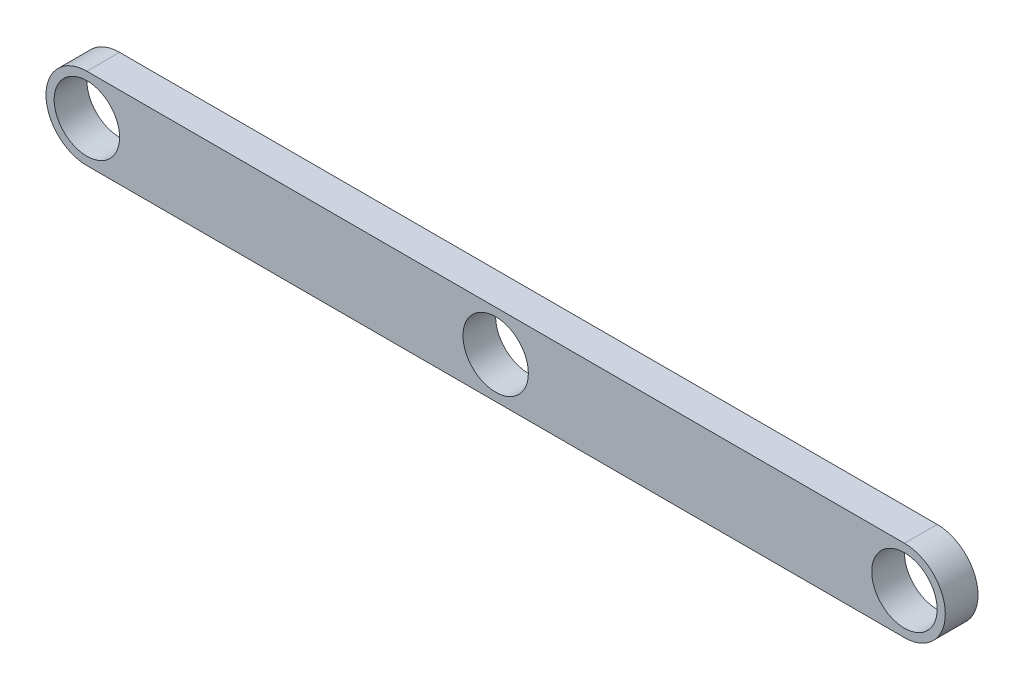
ISO-10303-21;
HEADER;
FILE_DESCRIPTION(('STEP AP214'),'2;1');
FILE_NAME('part.step','',(''),(''),'','','');
FILE_SCHEMA(('AUTOMOTIVE_DESIGN { 1 0 10303 214 1 1 1 1 }'));
ENDSEC;
DATA;
#1=APPLICATION_CONTEXT('core data for automotive mechanical design processes');
#2=APPLICATION_PROTOCOL_DEFINITION('international standard','automotive_design',2000,#1);
#3=PRODUCT_CONTEXT('',#1,'mechanical');
#4=PRODUCT('Part','Part','',(#3));
#5=PRODUCT_RELATED_PRODUCT_CATEGORY('part','',(#4));
#6=PRODUCT_DEFINITION_FORMATION('','',#4);
#7=PRODUCT_DEFINITION_CONTEXT('part definition',#1,'design');
#8=PRODUCT_DEFINITION('design','',#6,#7);
#9=PRODUCT_DEFINITION_SHAPE('','',#8);
#10=(LENGTH_UNIT() NAMED_UNIT(*) SI_UNIT(.MILLI.,.METRE.));
#11=(NAMED_UNIT(*) PLANE_ANGLE_UNIT() SI_UNIT($,.RADIAN.));
#12=(NAMED_UNIT(*) SI_UNIT($,.STERADIAN.) SOLID_ANGLE_UNIT());
#13=UNCERTAINTY_MEASURE_WITH_UNIT(LENGTH_MEASURE(1.E-05),#10,'distance_accuracy_value','');
#14=(GEOMETRIC_REPRESENTATION_CONTEXT(3) GLOBAL_UNCERTAINTY_ASSIGNED_CONTEXT((#13)) GLOBAL_UNIT_ASSIGNED_CONTEXT((#10,
#11,#12)) REPRESENTATION_CONTEXT('',''));
#15=CARTESIAN_POINT('',(0.,0.,0.));
#16=DIRECTION('',(0.,0.,1.));
#17=DIRECTION('',(1.,0.,0.));
#18=AXIS2_PLACEMENT_3D('',#15,#16,#17);
#19=CARTESIAN_POINT('',(1275.04046692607,63.5000000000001,-50.7999999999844));
#20=DIRECTION('',(0.,0.,1.));
#21=DIRECTION('',(1.,0.,0.));
#22=AXIS2_PLACEMENT_3D('',#19,#20,#21);
#23=CYLINDRICAL_SURFACE('',#22,63.5);
#24=CARTESIAN_POINT('',(1275.04046692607,63.5000000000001,1.55431223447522E-11));
#25=DIRECTION('',(0.,0.,1.));
#26=DIRECTION('',(-1.,0.,0.));
#27=AXIS2_PLACEMENT_3D('',#24,#25,#26);
#28=CIRCLE('',#27,63.5);
#29=CARTESIAN_POINT('',(1275.04046692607,1.11022302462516E-13,1.55431223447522E-11));
#30=VERTEX_POINT('',#29);
#31=CARTESIAN_POINT('',(1275.04046692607,127.,1.55431223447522E-11));
#32=VERTEX_POINT('',#31);
#33=EDGE_CURVE('E390',#30,#32,#28,.T.);
#34=ORIENTED_EDGE('',*,*,#33,.F.);
#35=DIRECTION('',(0.,0.,1.));
#36=VECTOR('',#35,1.);
#37=CARTESIAN_POINT('',(1275.04046692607,1.11022302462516E-13,-50.7999999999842));
#38=LINE('',#37,#36);
#39=CARTESIAN_POINT('',(1275.04046692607,1.11022302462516E-13,-50.7999999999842));
#40=VERTEX_POINT('',#39);
#41=EDGE_CURVE('E11',#40,#30,#38,.T.);
#42=ORIENTED_EDGE('',*,*,#41,.F.);
#43=CARTESIAN_POINT('',(1275.04046692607,63.5000000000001,-50.7999999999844));
#44=DIRECTION('',(0.,0.,1.));
#45=DIRECTION('',(-1.,0.,0.));
#46=AXIS2_PLACEMENT_3D('',#43,#44,#45);
#47=CIRCLE('',#46,63.5);
#48=CARTESIAN_POINT('',(1275.04046692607,127.,-50.7999999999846));
#49=VERTEX_POINT('',#48);
#50=EDGE_CURVE('E392',#40,#49,#47,.T.);
#51=ORIENTED_EDGE('',*,*,#50,.T.);
#52=DIRECTION('',(0.,0.,1.));
#53=VECTOR('',#52,1.);
#54=CARTESIAN_POINT('',(1275.04046692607,127.,-50.7999999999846));
#55=LINE('',#54,#53);
#56=EDGE_CURVE('E353',#49,#32,#55,.T.);
#57=ORIENTED_EDGE('',*,*,#56,.T.);
#58=EDGE_LOOP('',(#34,#42,#51,#57));
#59=FACE_BOUND('',#58,.T.);
#60=ADVANCED_FACE('F350',(#59),#23,.T.);
#61=CARTESIAN_POINT('',(1275.04046692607,1.11022302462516E-13,-50.7999999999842));
#62=DIRECTION('',(0.,-1.,0.));
#63=DIRECTION('',(1.,0.,0.));
#64=AXIS2_PLACEMENT_3D('',#61,#62,#63);
#65=PLANE('',#64);
#66=DIRECTION('',(1.,0.,0.));
#67=VECTOR('',#66,1.);
#68=CARTESIAN_POINT('',(1275.04046692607,1.11022302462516E-13,1.55431223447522E-11));
#69=LINE('',#68,#67);
#70=CARTESIAN_POINT('',(5.04046692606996,0.,0.));
#71=VERTEX_POINT('',#70);
#72=EDGE_CURVE('E407',#71,#30,#69,.T.);
#73=ORIENTED_EDGE('',*,*,#72,.F.);
#74=DIRECTION('',(0.,0.,1.));
#75=VECTOR('',#74,1.);
#76=CARTESIAN_POINT('',(5.04046692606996,1.11022302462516E-13,-50.8));
#77=LINE('',#76,#75);
#78=CARTESIAN_POINT('',(5.04046692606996,1.11022302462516E-13,-50.8));
#79=VERTEX_POINT('',#78);
#80=EDGE_CURVE('E358',#79,#71,#77,.T.);
#81=ORIENTED_EDGE('',*,*,#80,.F.);
#82=DIRECTION('',(1.,0.,0.));
#83=VECTOR('',#82,1.);
#84=CARTESIAN_POINT('',(1275.04046692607,1.11022302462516E-13,-50.7999999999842));
#85=LINE('',#84,#83);
#86=EDGE_CURVE('E397',#79,#40,#85,.T.);
#87=ORIENTED_EDGE('',*,*,#86,.T.);
#88=ORIENTED_EDGE('',*,*,#41,.T.);
#89=EDGE_LOOP('',(#73,#81,#87,#88));
#90=FACE_BOUND('',#89,.T.);
#91=ADVANCED_FACE('F427',(#90),#65,.T.);
#92=CARTESIAN_POINT('',(5.04046692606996,63.5,-50.7999999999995));
#93=DIRECTION('',(0.,0.,1.));
#94=DIRECTION('',(1.,0.,0.));
#95=AXIS2_PLACEMENT_3D('',#92,#93,#94);
#96=CYLINDRICAL_SURFACE('',#95,63.5);
#97=CARTESIAN_POINT('',(5.04046692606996,63.5,0.));
#98=DIRECTION('',(0.,0.,1.));
#99=DIRECTION('',(1.,0.,0.));
#100=AXIS2_PLACEMENT_3D('',#97,#98,#99);
#101=CIRCLE('',#100,63.5);
#102=CARTESIAN_POINT('',(5.04046692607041,127.,1.55431223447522E-11));
#103=VERTEX_POINT('',#102);
#104=EDGE_CURVE('E404',#103,#71,#101,.T.);
#105=ORIENTED_EDGE('',*,*,#104,.F.);
#106=DIRECTION('',(0.,0.,1.));
#107=VECTOR('',#106,1.);
#108=CARTESIAN_POINT('',(5.04046692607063,127.,-50.799999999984));
#109=LINE('',#108,#107);
#110=CARTESIAN_POINT('',(5.04046692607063,127.,-50.799999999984));
#111=VERTEX_POINT('',#110);
#112=EDGE_CURVE('E396',#111,#103,#109,.T.);
#113=ORIENTED_EDGE('',*,*,#112,.F.);
#114=CARTESIAN_POINT('',(5.04046692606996,63.5,-50.7999999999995));
#115=DIRECTION('',(0.,0.,1.));
#116=DIRECTION('',(1.,0.,0.));
#117=AXIS2_PLACEMENT_3D('',#114,#115,#116);
#118=CIRCLE('',#117,63.5);
#119=EDGE_CURVE('E420',#111,#79,#118,.T.);
#120=ORIENTED_EDGE('',*,*,#119,.T.);
#121=ORIENTED_EDGE('',*,*,#80,.T.);
#122=EDGE_LOOP('',(#105,#113,#120,#121));
#123=FACE_BOUND('',#122,.T.);
#124=ADVANCED_FACE('F424',(#123),#96,.T.);
#125=CARTESIAN_POINT('',(1275.04046692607,127.,-50.7999999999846));
#126=DIRECTION('',(0.,1.,0.));
#127=DIRECTION('',(-1.,0.,0.));
#128=AXIS2_PLACEMENT_3D('',#125,#126,#127);
#129=PLANE('',#128);
#130=DIRECTION('',(-1.,0.,0.));
#131=VECTOR('',#130,1.);
#132=CARTESIAN_POINT('',(1275.04046692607,127.,1.55431223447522E-11));
#133=LINE('',#132,#131);
#134=EDGE_CURVE('E399',#32,#103,#133,.T.);
#135=ORIENTED_EDGE('',*,*,#134,.F.);
#136=ORIENTED_EDGE('',*,*,#56,.F.);
#137=DIRECTION('',(-1.,0.,0.));
#138=VECTOR('',#137,1.);
#139=CARTESIAN_POINT('',(1275.04046692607,127.,-50.7999999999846));
#140=LINE('',#139,#138);
#141=EDGE_CURVE('E418',#49,#111,#140,.T.);
#142=ORIENTED_EDGE('',*,*,#141,.T.);
#143=ORIENTED_EDGE('',*,*,#112,.T.);
#144=EDGE_LOOP('',(#135,#136,#142,#143));
#145=FACE_BOUND('',#144,.T.);
#146=ADVANCED_FACE('F400',(#145),#129,.T.);
#147=CARTESIAN_POINT('',(1275.04046692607,63.5000000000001,-50.7999999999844));
#148=DIRECTION('',(0.,0.,-1.));
#149=DIRECTION('',(-1.,0.,0.));
#150=AXIS2_PLACEMENT_3D('',#147,#148,#149);
#151=PLANE('',#150);
#152=CARTESIAN_POINT('',(5.04046692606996,63.5,-50.7999999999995));
#153=DIRECTION('',(0.,0.,1.));
#154=DIRECTION('',(1.,0.,0.));
#155=AXIS2_PLACEMENT_3D('',#152,#153,#154);
#156=CIRCLE('',#155,50.8);
#157=CARTESIAN_POINT('',(55.84046692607,63.5,-50.7999999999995));
#158=VERTEX_POINT('',#157);
#159=EDGE_CURVE('E470',#158,#158,#156,.T.);
#160=ORIENTED_EDGE('',*,*,#159,.T.);
#161=EDGE_LOOP('',(#160));
#162=FACE_BOUND('',#161,.T.);
#163=CARTESIAN_POINT('',(1275.04046692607,63.5000000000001,-50.7999999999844));
#164=DIRECTION('',(0.,0.,1.));
#165=DIRECTION('',(1.,0.,0.));
#166=AXIS2_PLACEMENT_3D('',#163,#164,#165);
#167=CIRCLE('',#166,50.8);
#168=CARTESIAN_POINT('',(1325.84046692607,63.5000000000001,-50.7999999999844));
#169=VERTEX_POINT('',#168);
#170=EDGE_CURVE('E480',#169,#169,#167,.T.);
#171=ORIENTED_EDGE('',*,*,#170,.T.);
#172=EDGE_LOOP('',(#171));
#173=FACE_BOUND('',#172,.T.);
#174=CARTESIAN_POINT('',(640.04046692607,63.5,-50.8));
#175=DIRECTION('',(0.,0.,1.));
#176=DIRECTION('',(1.,0.,0.));
#177=AXIS2_PLACEMENT_3D('',#174,#175,#176);
#178=CIRCLE('',#177,50.8);
#179=CARTESIAN_POINT('',(690.84046692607,63.5,-50.8));
#180=VERTEX_POINT('',#179);
#181=EDGE_CURVE('E408',#180,#180,#178,.T.);
#182=ORIENTED_EDGE('',*,*,#181,.T.);
#183=EDGE_LOOP('',(#182));
#184=FACE_BOUND('',#183,.T.);
#185=ORIENTED_EDGE('',*,*,#50,.F.);
#186=ORIENTED_EDGE('',*,*,#86,.F.);
#187=ORIENTED_EDGE('',*,*,#119,.F.);
#188=ORIENTED_EDGE('',*,*,#141,.F.);
#189=EDGE_LOOP('',(#185,#186,#187,#188));
#190=FACE_BOUND('',#189,.T.);
#191=ADVANCED_FACE('F429',(#162,#173,#184,#190),#151,.T.);
#192=CARTESIAN_POINT('',(1275.04046692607,63.5000000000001,1.55431223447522E-11));
#193=DIRECTION('',(0.,0.,-1.));
#194=DIRECTION('',(-1.,0.,0.));
#195=AXIS2_PLACEMENT_3D('',#192,#193,#194);
#196=PLANE('',#195);
#197=CARTESIAN_POINT('',(5.04046692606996,63.5,0.));
#198=DIRECTION('',(0.,0.,1.));
#199=DIRECTION('',(1.,0.,0.));
#200=AXIS2_PLACEMENT_3D('',#197,#198,#199);
#201=CIRCLE('',#200,50.8);
#202=CARTESIAN_POINT('',(55.84046692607,63.5,0.));
#203=VERTEX_POINT('',#202);
#204=EDGE_CURVE('E473',#203,#203,#201,.T.);
#205=ORIENTED_EDGE('',*,*,#204,.F.);
#206=EDGE_LOOP('',(#205));
#207=FACE_BOUND('',#206,.T.);
#208=CARTESIAN_POINT('',(1275.04046692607,63.5000000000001,1.55431223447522E-11));
#209=DIRECTION('',(0.,0.,1.));
#210=DIRECTION('',(1.,0.,0.));
#211=AXIS2_PLACEMENT_3D('',#208,#209,#210);
#212=CIRCLE('',#211,50.8);
#213=CARTESIAN_POINT('',(1325.84046692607,63.5000000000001,1.55431223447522E-11));
#214=VERTEX_POINT('',#213);
#215=EDGE_CURVE('E475',#214,#214,#212,.T.);
#216=ORIENTED_EDGE('',*,*,#215,.F.);
#217=EDGE_LOOP('',(#216));
#218=FACE_BOUND('',#217,.T.);
#219=CARTESIAN_POINT('',(640.040466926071,63.500000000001,0.));
#220=DIRECTION('',(0.,0.,1.));
#221=DIRECTION('',(1.,0.,0.));
#222=AXIS2_PLACEMENT_3D('',#219,#220,#221);
#223=CIRCLE('',#222,50.8);
#224=CARTESIAN_POINT('',(690.840466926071,63.500000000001,0.));
#225=VERTEX_POINT('',#224);
#226=EDGE_CURVE('E411',#225,#225,#223,.T.);
#227=ORIENTED_EDGE('',*,*,#226,.F.);
#228=EDGE_LOOP('',(#227));
#229=FACE_BOUND('',#228,.T.);
#230=ORIENTED_EDGE('',*,*,#33,.T.);
#231=ORIENTED_EDGE('',*,*,#134,.T.);
#232=ORIENTED_EDGE('',*,*,#104,.T.);
#233=ORIENTED_EDGE('',*,*,#72,.T.);
#234=EDGE_LOOP('',(#230,#231,#232,#233));
#235=FACE_BOUND('',#234,.T.);
#236=ADVANCED_FACE('F406',(#207,#218,#229,#235),#196,.F.);
#237=CARTESIAN_POINT('',(640.04046692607,63.5,-50.8));
#238=DIRECTION('',(0.,0.,1.));
#239=DIRECTION('',(1.,0.,0.));
#240=AXIS2_PLACEMENT_3D('',#237,#238,#239);
#241=CYLINDRICAL_SURFACE('',#240,50.8);
#242=ORIENTED_EDGE('',*,*,#181,.F.);
#243=EDGE_LOOP('',(#242));
#244=FACE_BOUND('',#243,.T.);
#245=ORIENTED_EDGE('',*,*,#226,.T.);
#246=EDGE_LOOP('',(#245));
#247=FACE_BOUND('',#246,.T.);
#248=ADVANCED_FACE('F437',(#244,#247),#241,.F.);
#249=CARTESIAN_POINT('',(1275.04046692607,63.5000000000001,-50.7999999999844));
#250=DIRECTION('',(0.,0.,1.));
#251=DIRECTION('',(1.,0.,0.));
#252=AXIS2_PLACEMENT_3D('',#249,#250,#251);
#253=CYLINDRICAL_SURFACE('',#252,50.8);
#254=ORIENTED_EDGE('',*,*,#170,.F.);
#255=EDGE_LOOP('',(#254));
#256=FACE_BOUND('',#255,.T.);
#257=ORIENTED_EDGE('',*,*,#215,.T.);
#258=EDGE_LOOP('',(#257));
#259=FACE_BOUND('',#258,.T.);
#260=ADVANCED_FACE('F458',(#256,#259),#253,.F.);
#261=CARTESIAN_POINT('',(5.04046692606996,63.5,-50.7999999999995));
#262=DIRECTION('',(0.,0.,1.));
#263=DIRECTION('',(1.,0.,0.));
#264=AXIS2_PLACEMENT_3D('',#261,#262,#263);
#265=CYLINDRICAL_SURFACE('',#264,50.8);
#266=ORIENTED_EDGE('',*,*,#159,.F.);
#267=EDGE_LOOP('',(#266));
#268=FACE_BOUND('',#267,.T.);
#269=ORIENTED_EDGE('',*,*,#204,.T.);
#270=EDGE_LOOP('',(#269));
#271=FACE_BOUND('',#270,.T.);
#272=ADVANCED_FACE('F462',(#268,#271),#265,.F.);
#273=CLOSED_SHELL('',(#60,#91,#124,#146,#191,#236,#248,#260,#272));
#274=MANIFOLD_SOLID_BREP('B2',#273);
#275=ADVANCED_BREP_SHAPE_REPRESENTATION('',(#18,#274),#14);
#276=SHAPE_DEFINITION_REPRESENTATION(#9,#275);
ENDSEC;
END-ISO-10303-21;
